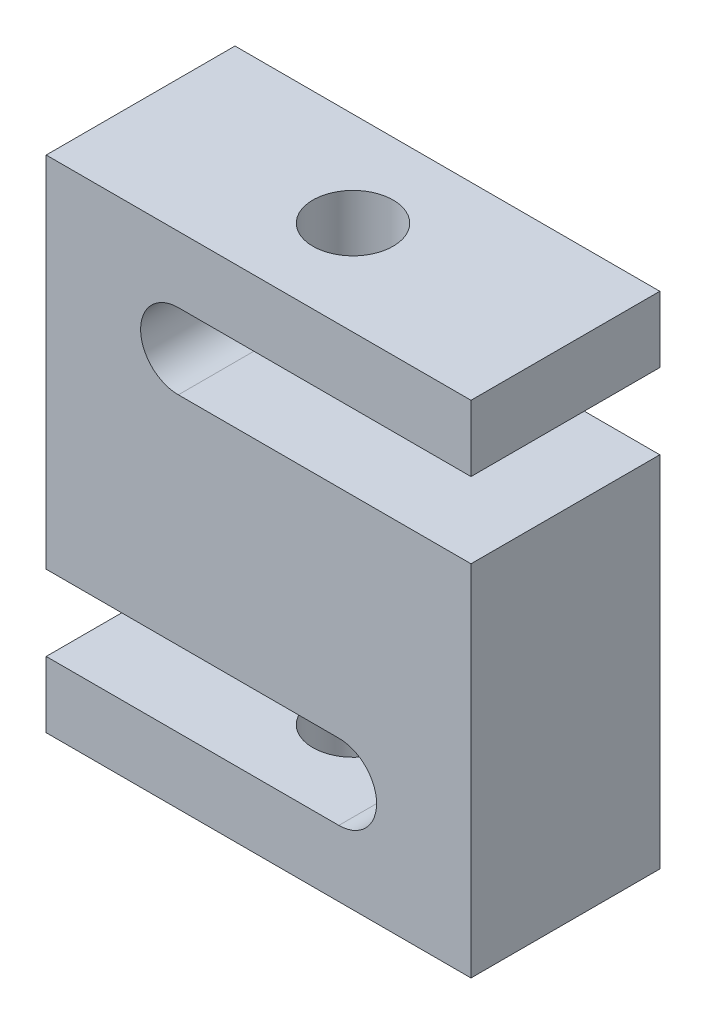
from build123d import *

# Parameters (mm, degrees)
ESQUISSE1_W                 = 45
ESQUISSE1_H                 = 53
EXTRUSION1_DEPTH            = 10
ENL_V_MAT_EXTRU_1_DEPTH     = 20
TROU_TARAUD_M10X1_51_REACH  = 60.44
TROU_TARAUD_M10X1_51_BORE_R = 4.25


with BuildPart() as part:
    # Esquisse1 → Extrusion1 (new, symmetric)
    with BuildSketch(Plane.XY):
        Rectangle(ESQUISSE1_W, ESQUISSE1_H)
    extrude(amount=EXTRUSION1_DEPTH, both=True)

    # Esquisse2 → Enl_v. mat.-Extru.1 (cut)
    with BuildSketch(Plane.XY.offset(10)):
        with BuildLine():
            Line((-8.5, 19.5), (27.295147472, 19.5))
            Line((27.295147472, 19.5), (30.971118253, 11.5))
            Line((30.971118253, 11.5), (-8.5, 11.5))
            ThreePointArc((-8.5, 11.5), (-12.5, 15.5), (-8.5, 19.5))
        make_face()
        with BuildLine():
            Line((8.5, -11.5), (-38.622396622, -11.5))
            Line((-38.622396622, -11.5), (-27.855992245, -19.5))
            Line((-27.855992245, -19.5), (8.5, -19.5))
            ThreePointArc((8.5, -19.5), (12.5, -15.5), (8.5, -11.5))
        make_face()
    extrude(amount=-ENL_V_MAT_EXTRU_1_DEPTH, mode=Mode.SUBTRACT)

    # Trou taraud_ M10x1.51 bore → Trou taraud_ M10x1.51 (cut, up to next)
    with BuildSketch(Plane(origin=(0, 26.5, 0), x_dir=(-1, 0, 0), z_dir=(0, 1, 0)), mode=Mode.PRIVATE) as trou_taraud_m10x1_51_sk1:
        Circle(TROU_TARAUD_M10X1_51_BORE_R)
    trou_taraud_m10x1_51_tool1 = extrude(trou_taraud_m10x1_51_sk1.sketch, amount=-TROU_TARAUD_M10X1_51_REACH, mode=Mode.PRIVATE) & part.part
    trou_taraud_m10x1_51 = trou_taraud_m10x1_51_tool1.solids().sort_by_distance((0, 26.5, 0))[0]
    add(trou_taraud_m10x1_51, mode=Mode.SUBTRACT)

    # Sym_trie1: Trou taraud_ M10x1.51 across plane
    add(trou_taraud_m10x1_51.mirror(Plane.ZX), mode=Mode.SUBTRACT)


solid = part.part
